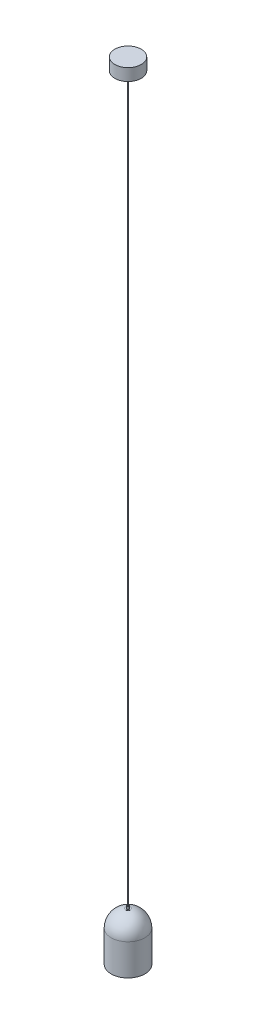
from build123d import *

# Parameters (mm, degrees)
VACIADO1_T              = -3
CROQUIS3_R              = 5
SALIENTE_EXTRUIR1_DEPTH = 10
CROQUIS4_R              = 10
SALIENTE_EXTRUIR2_DEPTH = 1
CROQUIS5_R              = 1.5
SALIENTE_EXTRUIR3_DEPTH = 3000
CROQUIS6_R              = 54.991
SALIENTE_EXTRUIR4_DEPTH = 50.038


with BuildPart() as part:
    # Croquis1 → Revoluci_n1 (revolve)
    with BuildSketch(Plane.XY, mode=Mode.PRIVATE) as revoluci_n1_sk:
        with BuildLine():
            Line((0, 0), (0, 200))
            ThreePointArc((0, 200), (-49.497474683, 179.497474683), (-70, 130))
            Line((-70, 130), (-70, 0))
            Line((-70, 0), (0, 0))
        make_face()
    revolve(revoluci_n1_sk.sketch.rotate(Axis((0, 0, 0), (0, 1, 0)), 180), axis=Axis((0, 0, 0), (0, 1, 0)))

    # Vaciado1
    vaciado1_openings = [part.faces().sort_by_distance(p)[0] for p in [
        (0, 0, 0),
    ]]
    offset(amount=VACIADO1_T, openings=vaciado1_openings, kind=Kind.INTERSECTION)


with BuildPart() as body_2:
    # Croquis3 → Saliente-Extruir1 (new body)
    with BuildSketch(Plane(origin=(0, 200, 0), x_dir=(1, 0, 0), z_dir=(0, 1, 0))):
        with Locations(Location((0, 0, 0), (0, 0, 270))):
            Circle(CROQUIS3_R)
    extrude(amount=SALIENTE_EXTRUIR1_DEPTH)


with BuildPart() as body_3:
    # Croquis4 → Saliente-Extruir2 (new body)
    with BuildSketch(Plane(origin=(0, 200, 0), x_dir=(1, 0, 0), z_dir=(0, 1, 0))):
        with Locations(Location((0, 0, 0), (0, 0, 270))):
            Circle(CROQUIS4_R)
    extrude(amount=SALIENTE_EXTRUIR2_DEPTH)


with BuildPart() as body_4:
    # Croquis5 → Saliente-Extruir3 (new body)
    with BuildSketch(Plane(origin=(0, 210, 0), x_dir=(1, 0, 0), z_dir=(0, 1, 0))):
        with Locations(Location((0, 0, 0), (0, 0, 270))):
            Circle(CROQUIS5_R)
    extrude(amount=SALIENTE_EXTRUIR3_DEPTH)

    # Croquis6 → Saliente-Extruir4 (add)
    with BuildSketch(Plane(origin=(0, 3210, 0), x_dir=(1, 0, 0), z_dir=(0, 1, 0))):
        with Locations(Location((0, 0, 0), (0, 0, 270))):
            Circle(CROQUIS6_R)
    extrude(amount=SALIENTE_EXTRUIR4_DEPTH)


solid = Compound([part.part, body_2.part, body_3.part, body_4.part])
